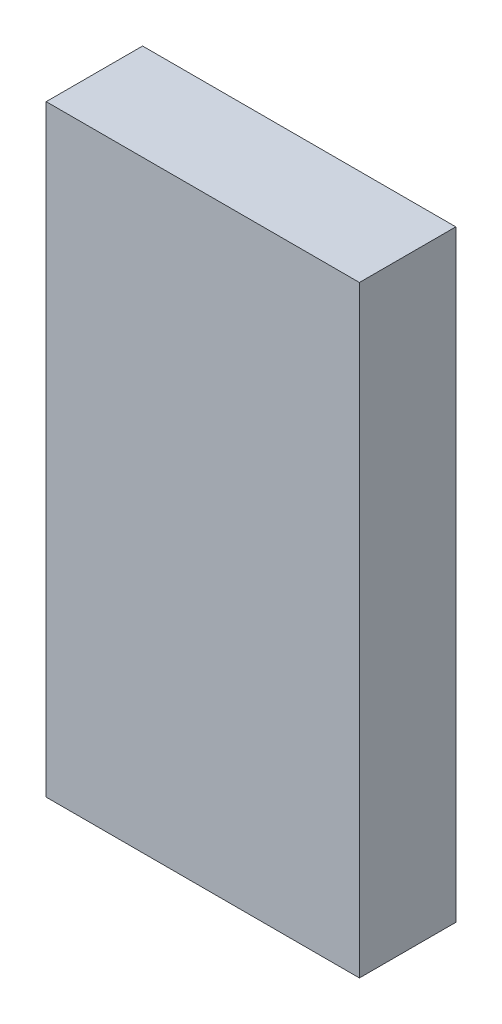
ISO-10303-21;
HEADER;
FILE_DESCRIPTION(('STEP AP214'),'2;1');
FILE_NAME('part.step','',(''),(''),'','','');
FILE_SCHEMA(('AUTOMOTIVE_DESIGN { 1 0 10303 214 1 1 1 1 }'));
ENDSEC;
DATA;
#1=APPLICATION_CONTEXT('core data for automotive mechanical design processes');
#2=APPLICATION_PROTOCOL_DEFINITION('international standard','automotive_design',2000,#1);
#3=PRODUCT_CONTEXT('',#1,'mechanical');
#4=PRODUCT('Part','Part','',(#3));
#5=PRODUCT_RELATED_PRODUCT_CATEGORY('part','',(#4));
#6=PRODUCT_DEFINITION_FORMATION('','',#4);
#7=PRODUCT_DEFINITION_CONTEXT('part definition',#1,'design');
#8=PRODUCT_DEFINITION('design','',#6,#7);
#9=PRODUCT_DEFINITION_SHAPE('','',#8);
#10=(LENGTH_UNIT() NAMED_UNIT(*) SI_UNIT(.MILLI.,.METRE.));
#11=(NAMED_UNIT(*) PLANE_ANGLE_UNIT() SI_UNIT($,.RADIAN.));
#12=(NAMED_UNIT(*) SI_UNIT($,.STERADIAN.) SOLID_ANGLE_UNIT());
#13=UNCERTAINTY_MEASURE_WITH_UNIT(LENGTH_MEASURE(1.E-05),#10,'distance_accuracy_value','');
#14=(GEOMETRIC_REPRESENTATION_CONTEXT(3) GLOBAL_UNCERTAINTY_ASSIGNED_CONTEXT((#13)) GLOBAL_UNIT_ASSIGNED_CONTEXT((#10,
#11,#12)) REPRESENTATION_CONTEXT('',''));
#15=CARTESIAN_POINT('',(0.,0.,0.));
#16=DIRECTION('',(0.,0.,1.));
#17=DIRECTION('',(1.,0.,0.));
#18=AXIS2_PLACEMENT_3D('',#15,#16,#17);
#19=CARTESIAN_POINT('',(6.,0.,0.));
#20=DIRECTION('',(1.,0.,0.));
#21=DIRECTION('',(0.,0.,-1.));
#22=AXIS2_PLACEMENT_3D('',#19,#20,#21);
#23=PLANE('',#22);
#24=CARTESIAN_POINT('',(6.,62.5,10.));
#25=DIRECTION('',(1.,0.,0.));
#26=DIRECTION('',(0.,0.,-1.));
#27=AXIS2_PLACEMENT_3D('',#24,#25,#26);
#28=CIRCLE('',#27,6.);
#29=CARTESIAN_POINT('',(6.,62.5,4.));
#30=VERTEX_POINT('',#29);
#31=EDGE_CURVE('E20',#30,#30,#28,.F.);
#32=ORIENTED_EDGE('',*,*,#31,.T.);
#33=EDGE_LOOP('',(#32));
#34=FACE_BOUND('',#33,.T.);
#35=ADVANCED_FACE('F17',(#34),#23,.F.);
#36=CARTESIAN_POINT('',(0.,0.,20.));
#37=DIRECTION('',(0.,0.,1.));
#38=DIRECTION('',(1.,0.,0.));
#39=AXIS2_PLACEMENT_3D('',#36,#37,#38);
#40=PLANE('',#39);
#41=DIRECTION('',(1.,0.,0.));
#42=VECTOR('',#41,1.);
#43=CARTESIAN_POINT('',(65.,125.,20.));
#44=LINE('',#43,#42);
#45=CARTESIAN_POINT('',(0.,125.,20.));
#46=VERTEX_POINT('',#45);
#47=CARTESIAN_POINT('',(65.,125.,20.));
#48=VERTEX_POINT('',#47);
#49=EDGE_CURVE('E91',#46,#48,#44,.T.);
#50=ORIENTED_EDGE('',*,*,#49,.F.);
#51=DIRECTION('',(0.,1.,0.));
#52=VECTOR('',#51,1.);
#53=CARTESIAN_POINT('',(0.,125.,20.));
#54=LINE('',#53,#52);
#55=CARTESIAN_POINT('',(0.,0.,20.));
#56=VERTEX_POINT('',#55);
#57=EDGE_CURVE('E60',#56,#46,#54,.T.);
#58=ORIENTED_EDGE('',*,*,#57,.F.);
#59=DIRECTION('',(1.,0.,0.));
#60=VECTOR('',#59,1.);
#61=CARTESIAN_POINT('',(0.,0.,20.));
#62=LINE('',#61,#60);
#63=CARTESIAN_POINT('',(65.,0.,20.));
#64=VERTEX_POINT('',#63);
#65=EDGE_CURVE('E58',#64,#56,#62,.F.);
#66=ORIENTED_EDGE('',*,*,#65,.F.);
#67=DIRECTION('',(0.,1.,0.));
#68=VECTOR('',#67,1.);
#69=CARTESIAN_POINT('',(65.,0.,20.));
#70=LINE('',#69,#68);
#71=EDGE_CURVE('E55',#48,#64,#70,.F.);
#72=ORIENTED_EDGE('',*,*,#71,.F.);
#73=EDGE_LOOP('',(#50,#58,#66,#72));
#74=FACE_BOUND('',#73,.T.);
#75=ADVANCED_FACE('F59',(#74),#40,.T.);
#76=CARTESIAN_POINT('',(3.,62.5,10.));
#77=DIRECTION('',(1.,0.,0.));
#78=DIRECTION('',(0.,0.,-1.));
#79=AXIS2_PLACEMENT_3D('',#76,#77,#78);
#80=CYLINDRICAL_SURFACE('',#79,6.);
#81=CARTESIAN_POINT('',(0.,62.5,10.));
#82=DIRECTION('',(1.,0.,0.));
#83=DIRECTION('',(0.,0.,-1.));
#84=AXIS2_PLACEMENT_3D('',#81,#82,#83);
#85=CIRCLE('',#84,6.);
#86=CARTESIAN_POINT('',(0.,62.5,4.));
#87=VERTEX_POINT('',#86);
#88=EDGE_CURVE('E79',#87,#87,#85,.T.);
#89=ORIENTED_EDGE('',*,*,#88,.F.);
#90=EDGE_LOOP('',(#89));
#91=FACE_BOUND('',#90,.T.);
#92=ORIENTED_EDGE('',*,*,#31,.F.);
#93=EDGE_LOOP('',(#92));
#94=FACE_BOUND('',#93,.T.);
#95=ADVANCED_FACE('F114',(#91,#94),#80,.F.);
#96=CARTESIAN_POINT('',(0.,0.,0.));
#97=DIRECTION('',(0.,-1.,0.));
#98=DIRECTION('',(0.,0.,-1.));
#99=AXIS2_PLACEMENT_3D('',#96,#97,#98);
#100=PLANE('',#99);
#101=DIRECTION('',(0.,0.,-1.));
#102=VECTOR('',#101,1.);
#103=CARTESIAN_POINT('',(65.,0.,0.));
#104=LINE('',#103,#102);
#105=CARTESIAN_POINT('',(65.,0.,0.));
#106=VERTEX_POINT('',#105);
#107=EDGE_CURVE('E65',#64,#106,#104,.T.);
#108=ORIENTED_EDGE('',*,*,#107,.F.);
#109=ORIENTED_EDGE('',*,*,#65,.T.);
#110=DIRECTION('',(0.,0.,1.));
#111=VECTOR('',#110,1.);
#112=CARTESIAN_POINT('',(0.,0.,0.));
#113=LINE('',#112,#111);
#114=CARTESIAN_POINT('',(0.,0.,0.));
#115=VERTEX_POINT('',#114);
#116=EDGE_CURVE('E85',#115,#56,#113,.T.);
#117=ORIENTED_EDGE('',*,*,#116,.F.);
#118=DIRECTION('',(1.,0.,0.));
#119=VECTOR('',#118,1.);
#120=CARTESIAN_POINT('',(0.,0.,0.));
#121=LINE('',#120,#119);
#122=EDGE_CURVE('E76',#115,#106,#121,.T.);
#123=ORIENTED_EDGE('',*,*,#122,.T.);
#124=EDGE_LOOP('',(#108,#109,#117,#123));
#125=FACE_BOUND('',#124,.T.);
#126=ADVANCED_FACE('F75',(#125),#100,.T.);
#127=CARTESIAN_POINT('',(65.,0.,0.));
#128=DIRECTION('',(1.,0.,0.));
#129=DIRECTION('',(0.,0.,-1.));
#130=AXIS2_PLACEMENT_3D('',#127,#128,#129);
#131=PLANE('',#130);
#132=DIRECTION('',(0.,0.,1.));
#133=VECTOR('',#132,1.);
#134=CARTESIAN_POINT('',(65.,125.,0.));
#135=LINE('',#134,#133);
#136=CARTESIAN_POINT('',(65.,125.,0.));
#137=VERTEX_POINT('',#136);
#138=EDGE_CURVE('E72',#48,#137,#135,.F.);
#139=ORIENTED_EDGE('',*,*,#138,.F.);
#140=ORIENTED_EDGE('',*,*,#71,.T.);
#141=ORIENTED_EDGE('',*,*,#107,.T.);
#142=DIRECTION('',(0.,1.,0.));
#143=VECTOR('',#142,1.);
#144=CARTESIAN_POINT('',(65.,0.,0.));
#145=LINE('',#144,#143);
#146=EDGE_CURVE('E83',#106,#137,#145,.T.);
#147=ORIENTED_EDGE('',*,*,#146,.T.);
#148=EDGE_LOOP('',(#139,#140,#141,#147));
#149=FACE_BOUND('',#148,.T.);
#150=ADVANCED_FACE('F69',(#149),#131,.T.);
#151=CARTESIAN_POINT('',(65.,125.,0.));
#152=DIRECTION('',(0.,1.,0.));
#153=DIRECTION('',(0.,0.,1.));
#154=AXIS2_PLACEMENT_3D('',#151,#152,#153);
#155=PLANE('',#154);
#156=DIRECTION('',(0.,0.,1.));
#157=VECTOR('',#156,1.);
#158=CARTESIAN_POINT('',(0.,125.,0.));
#159=LINE('',#158,#157);
#160=CARTESIAN_POINT('',(0.,125.,0.));
#161=VERTEX_POINT('',#160);
#162=EDGE_CURVE('E34',#46,#161,#159,.F.);
#163=ORIENTED_EDGE('',*,*,#162,.F.);
#164=ORIENTED_EDGE('',*,*,#49,.T.);
#165=ORIENTED_EDGE('',*,*,#138,.T.);
#166=DIRECTION('',(1.,0.,0.));
#167=VECTOR('',#166,1.);
#168=CARTESIAN_POINT('',(0.,125.,0.));
#169=LINE('',#168,#167);
#170=EDGE_CURVE('E26',#137,#161,#169,.F.);
#171=ORIENTED_EDGE('',*,*,#170,.T.);
#172=EDGE_LOOP('',(#163,#164,#165,#171));
#173=FACE_BOUND('',#172,.T.);
#174=ADVANCED_FACE('F95',(#173),#155,.T.);
#175=CARTESIAN_POINT('',(0.,125.,0.));
#176=DIRECTION('',(-1.,0.,0.));
#177=DIRECTION('',(0.,0.,1.));
#178=AXIS2_PLACEMENT_3D('',#175,#176,#177);
#179=PLANE('',#178);
#180=ORIENTED_EDGE('',*,*,#88,.T.);
#181=EDGE_LOOP('',(#180));
#182=FACE_BOUND('',#181,.T.);
#183=ORIENTED_EDGE('',*,*,#116,.T.);
#184=ORIENTED_EDGE('',*,*,#57,.T.);
#185=ORIENTED_EDGE('',*,*,#162,.T.);
#186=DIRECTION('',(0.,1.,0.));
#187=VECTOR('',#186,1.);
#188=CARTESIAN_POINT('',(0.,0.,0.));
#189=LINE('',#188,#187);
#190=EDGE_CURVE('E11',#161,#115,#189,.F.);
#191=ORIENTED_EDGE('',*,*,#190,.T.);
#192=EDGE_LOOP('',(#183,#184,#185,#191));
#193=FACE_BOUND('',#192,.T.);
#194=ADVANCED_FACE('F99',(#182,#193),#179,.T.);
#195=CARTESIAN_POINT('',(0.,0.,0.));
#196=DIRECTION('',(0.,0.,1.));
#197=DIRECTION('',(1.,0.,0.));
#198=AXIS2_PLACEMENT_3D('',#195,#196,#197);
#199=PLANE('',#198);
#200=ORIENTED_EDGE('',*,*,#170,.F.);
#201=ORIENTED_EDGE('',*,*,#146,.F.);
#202=ORIENTED_EDGE('',*,*,#122,.F.);
#203=ORIENTED_EDGE('',*,*,#190,.F.);
#204=EDGE_LOOP('',(#200,#201,#202,#203));
#205=FACE_BOUND('',#204,.T.);
#206=ADVANCED_FACE('F97',(#205),#199,.F.);
#207=CLOSED_SHELL('',(#35,#75,#95,#126,#150,#174,#194,#206));
#208=MANIFOLD_SOLID_BREP('B1',#207);
#209=ADVANCED_BREP_SHAPE_REPRESENTATION('',(#18,#208),#14);
#210=SHAPE_DEFINITION_REPRESENTATION(#9,#209);
ENDSEC;
END-ISO-10303-21;
